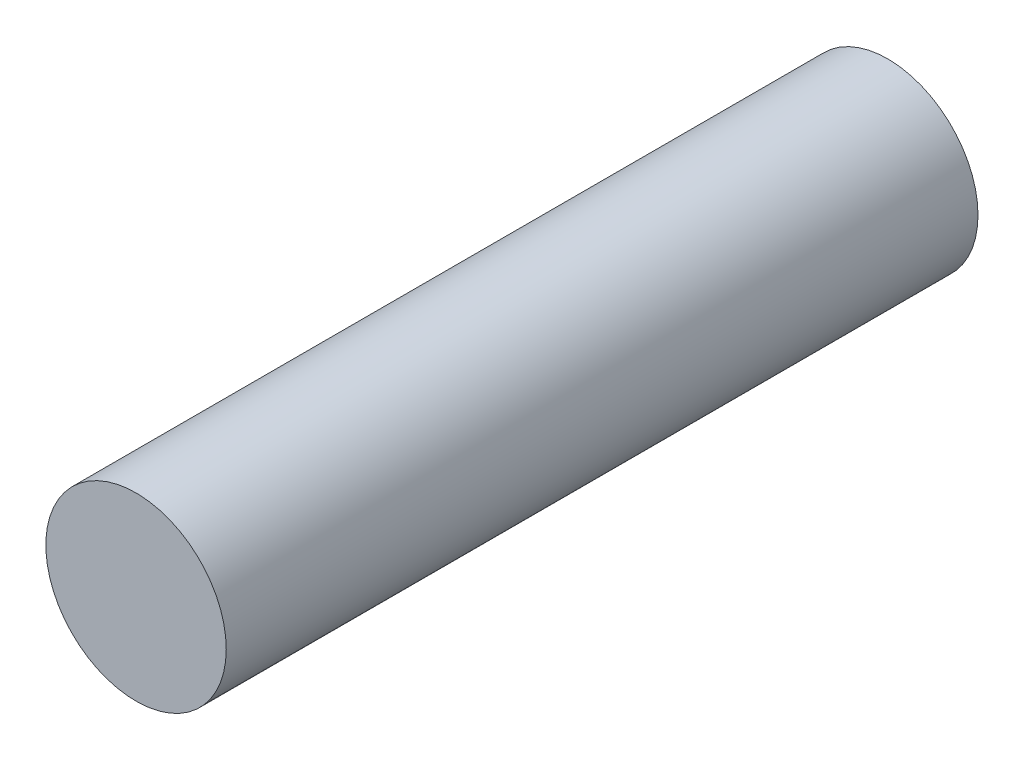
ISO-10303-21;
HEADER;
FILE_DESCRIPTION(('STEP AP214'),'2;1');
FILE_NAME('part.step','',(''),(''),'','','');
FILE_SCHEMA(('AUTOMOTIVE_DESIGN { 1 0 10303 214 1 1 1 1 }'));
ENDSEC;
DATA;
#1=APPLICATION_CONTEXT('core data for automotive mechanical design processes');
#2=APPLICATION_PROTOCOL_DEFINITION('international standard','automotive_design',2000,#1);
#3=PRODUCT_CONTEXT('',#1,'mechanical');
#4=PRODUCT('Part','Part','',(#3));
#5=PRODUCT_RELATED_PRODUCT_CATEGORY('part','',(#4));
#6=PRODUCT_DEFINITION_FORMATION('','',#4);
#7=PRODUCT_DEFINITION_CONTEXT('part definition',#1,'design');
#8=PRODUCT_DEFINITION('design','',#6,#7);
#9=PRODUCT_DEFINITION_SHAPE('','',#8);
#10=(LENGTH_UNIT() NAMED_UNIT(*) SI_UNIT(.MILLI.,.METRE.));
#11=(NAMED_UNIT(*) PLANE_ANGLE_UNIT() SI_UNIT($,.RADIAN.));
#12=(NAMED_UNIT(*) SI_UNIT($,.STERADIAN.) SOLID_ANGLE_UNIT());
#13=UNCERTAINTY_MEASURE_WITH_UNIT(LENGTH_MEASURE(1.E-05),#10,'distance_accuracy_value','');
#14=(GEOMETRIC_REPRESENTATION_CONTEXT(3) GLOBAL_UNCERTAINTY_ASSIGNED_CONTEXT((#13)) GLOBAL_UNIT_ASSIGNED_CONTEXT((#10,
#11,#12)) REPRESENTATION_CONTEXT('',''));
#15=CARTESIAN_POINT('',(0.,0.,0.));
#16=DIRECTION('',(0.,0.,1.));
#17=DIRECTION('',(1.,0.,0.));
#18=AXIS2_PLACEMENT_3D('',#15,#16,#17);
#19=CARTESIAN_POINT('',(0.,0.,-250.));
#20=DIRECTION('',(0.,0.,1.));
#21=DIRECTION('',(1.,0.,0.));
#22=AXIS2_PLACEMENT_3D('',#19,#20,#21);
#23=CYLINDRICAL_SURFACE('',#22,30.);
#24=CARTESIAN_POINT('',(0.,0.,-250.));
#25=DIRECTION('',(0.,0.,1.));
#26=DIRECTION('',(1.,0.,0.));
#27=AXIS2_PLACEMENT_3D('',#24,#25,#26);
#28=CIRCLE('',#27,30.);
#29=CARTESIAN_POINT('',(30.,0.,-250.));
#30=VERTEX_POINT('',#29);
#31=EDGE_CURVE('E10',#30,#30,#28,.T.);
#32=ORIENTED_EDGE('',*,*,#31,.T.);
#33=EDGE_LOOP('',(#32));
#34=FACE_BOUND('',#33,.T.);
#35=CARTESIAN_POINT('',(0.,0.,0.));
#36=DIRECTION('',(0.,0.,1.));
#37=DIRECTION('',(1.,0.,0.));
#38=AXIS2_PLACEMENT_3D('',#35,#36,#37);
#39=CIRCLE('',#38,30.);
#40=CARTESIAN_POINT('',(30.,0.,0.));
#41=VERTEX_POINT('',#40);
#42=EDGE_CURVE('E40',#41,#41,#39,.T.);
#43=ORIENTED_EDGE('',*,*,#42,.F.);
#44=EDGE_LOOP('',(#43));
#45=FACE_BOUND('',#44,.T.);
#46=ADVANCED_FACE('F37',(#34,#45),#23,.T.);
#47=CARTESIAN_POINT('',(0.,0.,-250.));
#48=DIRECTION('',(0.,0.,1.));
#49=DIRECTION('',(1.,0.,0.));
#50=AXIS2_PLACEMENT_3D('',#47,#48,#49);
#51=PLANE('',#50);
#52=ORIENTED_EDGE('',*,*,#31,.F.);
#53=EDGE_LOOP('',(#52));
#54=FACE_BOUND('',#53,.T.);
#55=ADVANCED_FACE('F54',(#54),#51,.F.);
#56=CARTESIAN_POINT('',(0.,0.,0.));
#57=DIRECTION('',(0.,0.,1.));
#58=DIRECTION('',(1.,0.,0.));
#59=AXIS2_PLACEMENT_3D('',#56,#57,#58);
#60=PLANE('',#59);
#61=ORIENTED_EDGE('',*,*,#42,.T.);
#62=EDGE_LOOP('',(#61));
#63=FACE_BOUND('',#62,.T.);
#64=ADVANCED_FACE('F51',(#63),#60,.T.);
#65=CLOSED_SHELL('',(#46,#55,#64));
#66=MANIFOLD_SOLID_BREP('B2',#65);
#67=ADVANCED_BREP_SHAPE_REPRESENTATION('',(#18,#66),#14);
#68=SHAPE_DEFINITION_REPRESENTATION(#9,#67);
ENDSEC;
END-ISO-10303-21;
